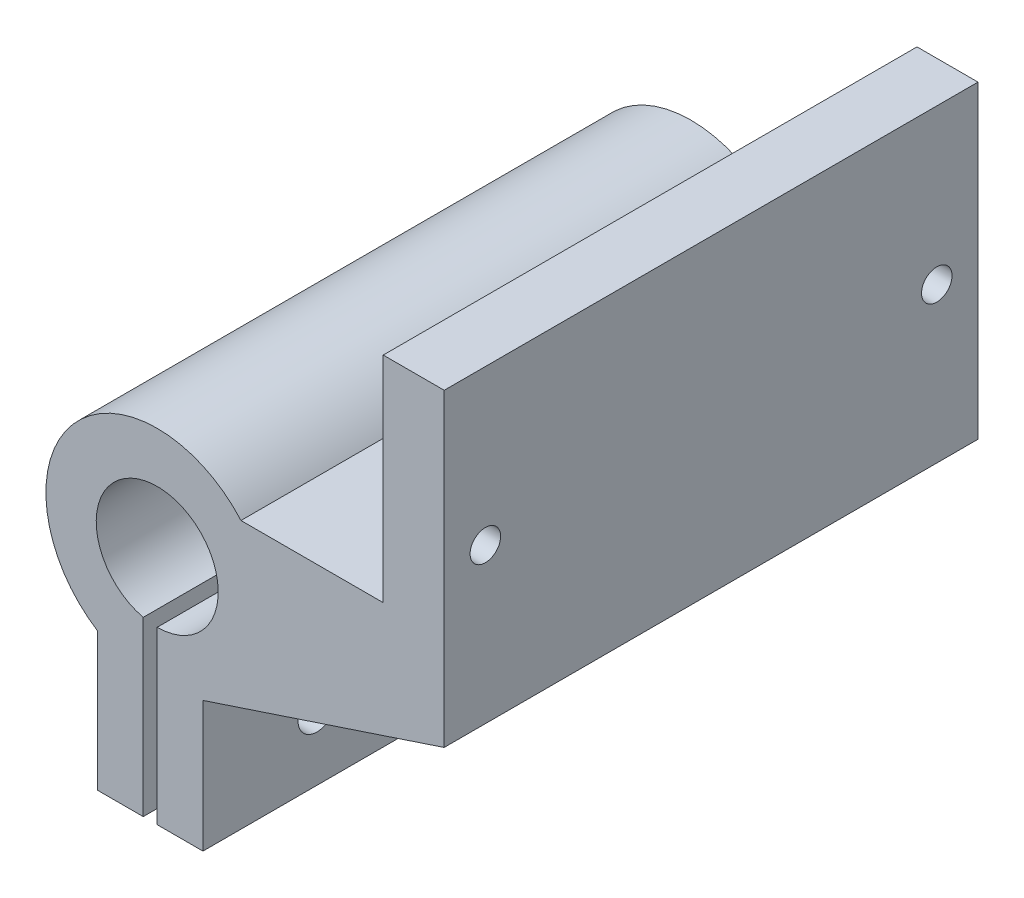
ISO-10303-21;
HEADER;
FILE_DESCRIPTION(('STEP AP214'),'2;1');
FILE_NAME('part.step','',(''),(''),'','','');
FILE_SCHEMA(('AUTOMOTIVE_DESIGN { 1 0 10303 214 1 1 1 1 }'));
ENDSEC;
DATA;
#1=APPLICATION_CONTEXT('core data for automotive mechanical design processes');
#2=APPLICATION_PROTOCOL_DEFINITION('international standard','automotive_design',2000,#1);
#3=PRODUCT_CONTEXT('',#1,'mechanical');
#4=PRODUCT('Part','Part','',(#3));
#5=PRODUCT_RELATED_PRODUCT_CATEGORY('part','',(#4));
#6=PRODUCT_DEFINITION_FORMATION('','',#4);
#7=PRODUCT_DEFINITION_CONTEXT('part definition',#1,'design');
#8=PRODUCT_DEFINITION('design','',#6,#7);
#9=PRODUCT_DEFINITION_SHAPE('','',#8);
#10=(LENGTH_UNIT() NAMED_UNIT(*) SI_UNIT(.MILLI.,.METRE.));
#11=(NAMED_UNIT(*) PLANE_ANGLE_UNIT() SI_UNIT($,.RADIAN.));
#12=(NAMED_UNIT(*) SI_UNIT($,.STERADIAN.) SOLID_ANGLE_UNIT());
#13=UNCERTAINTY_MEASURE_WITH_UNIT(LENGTH_MEASURE(1.E-05),#10,'distance_accuracy_value','');
#14=(GEOMETRIC_REPRESENTATION_CONTEXT(3) GLOBAL_UNCERTAINTY_ASSIGNED_CONTEXT((#13)) GLOBAL_UNIT_ASSIGNED_CONTEXT((#10,
#11,#12)) REPRESENTATION_CONTEXT('',''));
#15=CARTESIAN_POINT('',(0.,0.,0.));
#16=DIRECTION('',(0.,0.,1.));
#17=DIRECTION('',(1.,0.,0.));
#18=AXIS2_PLACEMENT_3D('',#15,#16,#17);
#19=CARTESIAN_POINT('',(41.5901479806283,218.770293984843,35.));
#20=DIRECTION('',(-0.999999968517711,0.000250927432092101,0.));
#21=DIRECTION('',(-0.000250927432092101,-0.999999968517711,0.));
#22=AXIS2_PLACEMENT_3D('',#19,#20,#21);
#23=PLANE('',#22);
#24=CARTESIAN_POINT('',(41.5876027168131,208.626868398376,32.3));
#25=DIRECTION('',(0.999999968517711,-0.000250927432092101,0.));
#26=DIRECTION('',(0.000250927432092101,0.999999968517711,0.));
#27=AXIS2_PLACEMENT_3D('',#24,#25,#26);
#28=CIRCLE('',#27,1.);
#29=CARTESIAN_POINT('',(41.5878536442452,209.626868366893,32.3));
#30=VERTEX_POINT('',#29);
#31=EDGE_CURVE('E220',#30,#30,#28,.T.);
#32=ORIENTED_EDGE('',*,*,#31,.F.);
#33=EDGE_LOOP('',(#32));
#34=FACE_BOUND('',#33,.T.);
#35=CARTESIAN_POINT('',(41.5876027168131,208.626868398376,2.7));
#36=DIRECTION('',(0.999999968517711,-0.000250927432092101,0.));
#37=DIRECTION('',(-0.000250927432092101,-0.999999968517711,0.));
#38=AXIS2_PLACEMENT_3D('',#35,#36,#37);
#39=CIRCLE('',#38,1.);
#40=CARTESIAN_POINT('',(41.587351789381,207.626868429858,2.7));
#41=VERTEX_POINT('',#40);
#42=EDGE_CURVE('E212',#41,#41,#39,.T.);
#43=ORIENTED_EDGE('',*,*,#42,.F.);
#44=EDGE_LOOP('',(#43));
#45=FACE_BOUND('',#44,.T.);
#46=DIRECTION('',(0.000250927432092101,0.999999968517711,0.));
#47=VECTOR('',#46,1.);
#48=CARTESIAN_POINT('',(41.5901479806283,218.770293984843,0.));
#49=LINE('',#48,#47);
#50=CARTESIAN_POINT('',(41.585057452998,198.483442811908,0.));
#51=VERTEX_POINT('',#50);
#52=CARTESIAN_POINT('',(41.5901479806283,218.770293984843,0.));
#53=VERTEX_POINT('',#52);
#54=EDGE_CURVE('E160',#51,#53,#49,.T.);
#55=ORIENTED_EDGE('',*,*,#54,.T.);
#56=DIRECTION('',(0.,0.,-1.));
#57=VECTOR('',#56,1.);
#58=CARTESIAN_POINT('',(41.5901479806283,218.770293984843,35.));
#59=LINE('',#58,#57);
#60=CARTESIAN_POINT('',(41.5901479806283,218.770293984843,35.));
#61=VERTEX_POINT('',#60);
#62=EDGE_CURVE('E11',#61,#53,#59,.T.);
#63=ORIENTED_EDGE('',*,*,#62,.F.);
#64=DIRECTION('',(0.000250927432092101,0.999999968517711,0.));
#65=VECTOR('',#64,1.);
#66=CARTESIAN_POINT('',(41.5901479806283,218.770293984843,35.));
#67=LINE('',#66,#65);
#68=CARTESIAN_POINT('',(41.585057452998,198.483442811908,35.));
#69=VERTEX_POINT('',#68);
#70=EDGE_CURVE('E185',#69,#61,#67,.T.);
#71=ORIENTED_EDGE('',*,*,#70,.F.);
#72=DIRECTION('',(0.,0.,-1.));
#73=VECTOR('',#72,1.);
#74=CARTESIAN_POINT('',(41.585057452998,198.483442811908,35.));
#75=LINE('',#74,#73);
#76=EDGE_CURVE('E156',#69,#51,#75,.T.);
#77=ORIENTED_EDGE('',*,*,#76,.T.);
#78=EDGE_LOOP('',(#55,#63,#71,#77));
#79=FACE_BOUND('',#78,.T.);
#80=ADVANCED_FACE('F32',(#34,#45,#79),#23,.F.);
#81=CARTESIAN_POINT('',(41.5901479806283,218.770293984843,35.));
#82=DIRECTION('',(0.,-1.,0.));
#83=DIRECTION('',(0.,0.,-1.));
#84=AXIS2_PLACEMENT_3D('',#81,#82,#83);
#85=PLANE('',#84);
#86=DIRECTION('',(-1.,0.,0.));
#87=VECTOR('',#86,1.);
#88=CARTESIAN_POINT('',(41.5901479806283,218.770293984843,0.));
#89=LINE('',#88,#87);
#90=CARTESIAN_POINT('',(37.5901479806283,218.770293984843,0.));
#91=VERTEX_POINT('',#90);
#92=EDGE_CURVE('E163',#53,#91,#89,.T.);
#93=ORIENTED_EDGE('',*,*,#92,.T.);
#94=DIRECTION('',(0.,0.,-1.));
#95=VECTOR('',#94,1.);
#96=CARTESIAN_POINT('',(37.5901479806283,218.770293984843,35.));
#97=LINE('',#96,#95);
#98=CARTESIAN_POINT('',(37.5901479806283,218.770293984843,35.));
#99=VERTEX_POINT('',#98);
#100=EDGE_CURVE('E41',#99,#91,#97,.T.);
#101=ORIENTED_EDGE('',*,*,#100,.F.);
#102=DIRECTION('',(-1.,0.,0.));
#103=VECTOR('',#102,1.);
#104=CARTESIAN_POINT('',(41.5901479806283,218.770293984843,35.));
#105=LINE('',#104,#103);
#106=EDGE_CURVE('E108',#61,#99,#105,.T.);
#107=ORIENTED_EDGE('',*,*,#106,.F.);
#108=ORIENTED_EDGE('',*,*,#62,.T.);
#109=EDGE_LOOP('',(#93,#101,#107,#108));
#110=FACE_BOUND('',#109,.T.);
#111=ADVANCED_FACE('F268',(#110),#85,.F.);
#112=CARTESIAN_POINT('',(37.5901479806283,218.770293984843,35.));
#113=DIRECTION('',(1.,0.,0.));
#114=DIRECTION('',(0.,1.,0.));
#115=AXIS2_PLACEMENT_3D('',#112,#113,#114);
#116=PLANE('',#115);
#117=CARTESIAN_POINT('',(37.5901479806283,208.627871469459,32.3));
#118=DIRECTION('',(1.,0.,0.));
#119=DIRECTION('',(0.,-1.,0.));
#120=AXIS2_PLACEMENT_3D('',#117,#118,#119);
#121=ELLIPSE('',#120,1.00000003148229,1.);
#122=CARTESIAN_POINT('',(37.5901479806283,207.627871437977,32.3));
#123=VERTEX_POINT('',#122);
#124=EDGE_CURVE('E35',#123,#123,#121,.T.);
#125=ORIENTED_EDGE('',*,*,#124,.T.);
#126=EDGE_LOOP('',(#125));
#127=FACE_BOUND('',#126,.T.);
#128=CARTESIAN_POINT('',(37.5901479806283,208.627871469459,2.7));
#129=DIRECTION('',(1.,0.,0.));
#130=DIRECTION('',(0.,-1.,0.));
#131=AXIS2_PLACEMENT_3D('',#128,#129,#130);
#132=ELLIPSE('',#131,1.00000003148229,1.);
#133=CARTESIAN_POINT('',(37.5901479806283,207.627871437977,2.7));
#134=VERTEX_POINT('',#133);
#135=EDGE_CURVE('E164',#134,#134,#132,.T.);
#136=ORIENTED_EDGE('',*,*,#135,.T.);
#137=EDGE_LOOP('',(#136));
#138=FACE_BOUND('',#137,.T.);
#139=DIRECTION('',(0.,-1.,0.));
#140=VECTOR('',#139,1.);
#141=CARTESIAN_POINT('',(37.5901479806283,218.770293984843,0.));
#142=LINE('',#141,#140);
#143=CARTESIAN_POINT('',(37.5901479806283,204.710145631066,0.));
#144=VERTEX_POINT('',#143);
#145=EDGE_CURVE('E166',#91,#144,#142,.T.);
#146=ORIENTED_EDGE('',*,*,#145,.T.);
#147=DIRECTION('',(0.,0.,-1.));
#148=VECTOR('',#147,1.);
#149=CARTESIAN_POINT('',(37.5901479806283,204.710145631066,35.));
#150=LINE('',#149,#148);
#151=CARTESIAN_POINT('',(37.5901479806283,204.710145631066,35.));
#152=VERTEX_POINT('',#151);
#153=EDGE_CURVE('E207',#152,#144,#150,.T.);
#154=ORIENTED_EDGE('',*,*,#153,.F.);
#155=DIRECTION('',(0.,-1.,0.));
#156=VECTOR('',#155,1.);
#157=CARTESIAN_POINT('',(37.5901479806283,218.770293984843,35.));
#158=LINE('',#157,#156);
#159=EDGE_CURVE('E226',#99,#152,#158,.T.);
#160=ORIENTED_EDGE('',*,*,#159,.F.);
#161=ORIENTED_EDGE('',*,*,#100,.T.);
#162=EDGE_LOOP('',(#146,#154,#160,#161));
#163=FACE_BOUND('',#162,.T.);
#164=ADVANCED_FACE('F273',(#127,#138,#163),#116,.F.);
#165=CARTESIAN_POINT('',(37.5901479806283,204.710145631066,35.));
#166=DIRECTION('',(0.,-1.,0.));
#167=DIRECTION('',(0.,0.,-1.));
#168=AXIS2_PLACEMENT_3D('',#165,#166,#167);
#169=PLANE('',#168);
#170=DIRECTION('',(-1.,0.,0.));
#171=VECTOR('',#170,1.);
#172=CARTESIAN_POINT('',(37.5901479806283,204.710145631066,0.));
#173=LINE('',#172,#171);
#174=CARTESIAN_POINT('',(28.2611395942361,204.710145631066,0.));
#175=VERTEX_POINT('',#174);
#176=EDGE_CURVE('E168',#144,#175,#173,.T.);
#177=ORIENTED_EDGE('',*,*,#176,.T.);
#178=DIRECTION('',(0.,0.,-1.));
#179=VECTOR('',#178,1.);
#180=CARTESIAN_POINT('',(28.2611395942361,204.710145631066,35.));
#181=LINE('',#180,#179);
#182=CARTESIAN_POINT('',(28.2611395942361,204.710145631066,35.));
#183=VERTEX_POINT('',#182);
#184=EDGE_CURVE('E204',#183,#175,#181,.T.);
#185=ORIENTED_EDGE('',*,*,#184,.F.);
#186=DIRECTION('',(-1.,0.,0.));
#187=VECTOR('',#186,1.);
#188=CARTESIAN_POINT('',(37.5901479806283,204.710145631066,35.));
#189=LINE('',#188,#187);
#190=EDGE_CURVE('E228',#152,#183,#189,.T.);
#191=ORIENTED_EDGE('',*,*,#190,.F.);
#192=ORIENTED_EDGE('',*,*,#153,.T.);
#193=EDGE_LOOP('',(#177,#185,#191,#192));
#194=FACE_BOUND('',#193,.T.);
#195=ADVANCED_FACE('F343',(#194),#169,.F.);
#196=CARTESIAN_POINT('',(22.7704220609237,199.902156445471,35.));
#197=DIRECTION('',(0.,0.,-1.));
#198=DIRECTION('',(-1.,0.,0.));
#199=AXIS2_PLACEMENT_3D('',#196,#197,#198);
#200=CYLINDRICAL_SURFACE('',#199,7.29826959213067);
#201=CARTESIAN_POINT('',(22.7704220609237,199.902156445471,0.));
#202=DIRECTION('',(0.,0.,1.));
#203=DIRECTION('',(1.,0.,0.));
#204=AXIS2_PLACEMENT_3D('',#201,#202,#203);
#205=CIRCLE('',#204,7.29826959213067);
#206=CARTESIAN_POINT('',(18.8539317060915,193.743760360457,0.));
#207=VERTEX_POINT('',#206);
#208=EDGE_CURVE('E170',#175,#207,#205,.T.);
#209=ORIENTED_EDGE('',*,*,#208,.T.);
#210=DIRECTION('',(0.,0.,-1.));
#211=VECTOR('',#210,1.);
#212=CARTESIAN_POINT('',(18.8539317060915,193.743760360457,35.));
#213=LINE('',#212,#211);
#214=CARTESIAN_POINT('',(18.8539317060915,193.743760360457,35.));
#215=VERTEX_POINT('',#214);
#216=EDGE_CURVE('E201',#215,#207,#213,.T.);
#217=ORIENTED_EDGE('',*,*,#216,.F.);
#218=CARTESIAN_POINT('',(22.7704220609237,199.902156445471,35.));
#219=DIRECTION('',(0.,0.,1.));
#220=DIRECTION('',(1.,0.,0.));
#221=AXIS2_PLACEMENT_3D('',#218,#219,#220);
#222=CIRCLE('',#221,7.29826959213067);
#223=EDGE_CURVE('E230',#183,#215,#222,.T.);
#224=ORIENTED_EDGE('',*,*,#223,.F.);
#225=ORIENTED_EDGE('',*,*,#184,.T.);
#226=EDGE_LOOP('',(#209,#217,#224,#225));
#227=FACE_BOUND('',#226,.T.);
#228=ADVANCED_FACE('F339',(#227),#200,.T.);
#229=CARTESIAN_POINT('',(18.8539317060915,193.743760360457,35.));
#230=DIRECTION('',(1.,0.,0.));
#231=DIRECTION('',(0.,0.,-1.));
#232=AXIS2_PLACEMENT_3D('',#229,#230,#231);
#233=PLANE('',#232);
#234=CARTESIAN_POINT('',(18.8539317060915,188.969409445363,27.5175352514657));
#235=DIRECTION('',(1.,0.,0.));
#236=DIRECTION('',(0.,0.,-1.));
#237=AXIS2_PLACEMENT_3D('',#234,#235,#236);
#238=CIRCLE('',#237,1.25);
#239=CARTESIAN_POINT('',(18.8539317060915,188.969409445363,26.2675352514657));
#240=VERTEX_POINT('',#239);
#241=EDGE_CURVE('E292',#240,#240,#238,.T.);
#242=ORIENTED_EDGE('',*,*,#241,.T.);
#243=EDGE_LOOP('',(#242));
#244=FACE_BOUND('',#243,.T.);
#245=CARTESIAN_POINT('',(18.8539317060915,188.969409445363,7.48246474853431));
#246=DIRECTION('',(1.,0.,0.));
#247=DIRECTION('',(0.,0.,-1.));
#248=AXIS2_PLACEMENT_3D('',#245,#246,#247);
#249=CIRCLE('',#248,1.25);
#250=CARTESIAN_POINT('',(18.8539317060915,188.969409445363,6.23246474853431));
#251=VERTEX_POINT('',#250);
#252=EDGE_CURVE('E278',#251,#251,#249,.T.);
#253=ORIENTED_EDGE('',*,*,#252,.T.);
#254=EDGE_LOOP('',(#253));
#255=FACE_BOUND('',#254,.T.);
#256=DIRECTION('',(0.,-1.,0.));
#257=VECTOR('',#256,1.);
#258=CARTESIAN_POINT('',(18.8539317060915,193.743760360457,0.));
#259=LINE('',#258,#257);
#260=CARTESIAN_POINT('',(18.8539317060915,184.689837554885,0.));
#261=VERTEX_POINT('',#260);
#262=EDGE_CURVE('E172',#207,#261,#259,.T.);
#263=ORIENTED_EDGE('',*,*,#262,.T.);
#264=DIRECTION('',(0.,0.,-1.));
#265=VECTOR('',#264,1.);
#266=CARTESIAN_POINT('',(18.8539317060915,184.689837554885,35.));
#267=LINE('',#266,#265);
#268=CARTESIAN_POINT('',(18.8539317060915,184.689837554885,35.));
#269=VERTEX_POINT('',#268);
#270=EDGE_CURVE('E198',#269,#261,#267,.T.);
#271=ORIENTED_EDGE('',*,*,#270,.F.);
#272=DIRECTION('',(0.,-1.,0.));
#273=VECTOR('',#272,1.);
#274=CARTESIAN_POINT('',(18.8539317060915,193.743760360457,35.));
#275=LINE('',#274,#273);
#276=EDGE_CURVE('E232',#215,#269,#275,.T.);
#277=ORIENTED_EDGE('',*,*,#276,.F.);
#278=ORIENTED_EDGE('',*,*,#216,.T.);
#279=EDGE_LOOP('',(#263,#271,#277,#278));
#280=FACE_BOUND('',#279,.T.);
#281=ADVANCED_FACE('F335',(#244,#255,#280),#233,.F.);
#282=CARTESIAN_POINT('',(18.8539317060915,184.689837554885,35.));
#283=DIRECTION('',(0.,1.,0.));
#284=DIRECTION('',(0.,0.,1.));
#285=AXIS2_PLACEMENT_3D('',#282,#283,#284);
#286=PLANE('',#285);
#287=DIRECTION('',(1.,0.,0.));
#288=VECTOR('',#287,1.);
#289=CARTESIAN_POINT('',(18.8539317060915,184.689837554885,0.));
#290=LINE('',#289,#288);
#291=CARTESIAN_POINT('',(21.8539317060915,184.689837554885,0.));
#292=VERTEX_POINT('',#291);
#293=EDGE_CURVE('E174',#261,#292,#290,.T.);
#294=ORIENTED_EDGE('',*,*,#293,.T.);
#295=DIRECTION('',(0.,0.,-1.));
#296=VECTOR('',#295,1.);
#297=CARTESIAN_POINT('',(21.8539317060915,184.689837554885,35.));
#298=LINE('',#297,#296);
#299=CARTESIAN_POINT('',(21.8539317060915,184.689837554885,35.));
#300=VERTEX_POINT('',#299);
#301=EDGE_CURVE('E195',#300,#292,#298,.T.);
#302=ORIENTED_EDGE('',*,*,#301,.F.);
#303=DIRECTION('',(1.,0.,0.));
#304=VECTOR('',#303,1.);
#305=CARTESIAN_POINT('',(18.8539317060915,184.689837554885,35.));
#306=LINE('',#305,#304);
#307=EDGE_CURVE('E234',#269,#300,#306,.T.);
#308=ORIENTED_EDGE('',*,*,#307,.F.);
#309=ORIENTED_EDGE('',*,*,#270,.T.);
#310=EDGE_LOOP('',(#294,#302,#308,#309));
#311=FACE_BOUND('',#310,.T.);
#312=ADVANCED_FACE('F331',(#311),#286,.F.);
#313=CARTESIAN_POINT('',(21.8539317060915,184.689837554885,35.));
#314=DIRECTION('',(-1.,0.,0.));
#315=DIRECTION('',(0.,0.,1.));
#316=AXIS2_PLACEMENT_3D('',#313,#314,#315);
#317=PLANE('',#316);
#318=CARTESIAN_POINT('',(21.8539317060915,188.969409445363,27.5175352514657));
#319=DIRECTION('',(-1.,0.,0.));
#320=DIRECTION('',(0.,0.,1.));
#321=AXIS2_PLACEMENT_3D('',#318,#319,#320);
#322=CIRCLE('',#321,1.25);
#323=CARTESIAN_POINT('',(21.8539317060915,188.969409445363,28.7675352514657));
#324=VERTEX_POINT('',#323);
#325=EDGE_CURVE('E295',#324,#324,#322,.T.);
#326=ORIENTED_EDGE('',*,*,#325,.T.);
#327=EDGE_LOOP('',(#326));
#328=FACE_BOUND('',#327,.T.);
#329=CARTESIAN_POINT('',(21.8539317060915,188.969409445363,7.48246474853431));
#330=DIRECTION('',(-1.,0.,0.));
#331=DIRECTION('',(0.,0.,1.));
#332=AXIS2_PLACEMENT_3D('',#329,#330,#331);
#333=CIRCLE('',#332,1.25);
#334=CARTESIAN_POINT('',(21.8539317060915,188.969409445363,8.73246474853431));
#335=VERTEX_POINT('',#334);
#336=EDGE_CURVE('E280',#335,#335,#333,.T.);
#337=ORIENTED_EDGE('',*,*,#336,.T.);
#338=EDGE_LOOP('',(#337));
#339=FACE_BOUND('',#338,.T.);
#340=DIRECTION('',(0.,1.,0.));
#341=VECTOR('',#340,1.);
#342=CARTESIAN_POINT('',(21.8539317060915,184.689837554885,0.));
#343=LINE('',#342,#341);
#344=CARTESIAN_POINT('',(21.8539317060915,196.008566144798,0.));
#345=VERTEX_POINT('',#344);
#346=EDGE_CURVE('E176',#292,#345,#343,.T.);
#347=ORIENTED_EDGE('',*,*,#346,.T.);
#348=DIRECTION('',(0.,0.,-1.));
#349=VECTOR('',#348,1.);
#350=CARTESIAN_POINT('',(21.8539317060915,196.008566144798,35.));
#351=LINE('',#350,#349);
#352=CARTESIAN_POINT('',(21.8539317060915,196.008566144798,35.));
#353=VERTEX_POINT('',#352);
#354=EDGE_CURVE('E192',#353,#345,#351,.T.);
#355=ORIENTED_EDGE('',*,*,#354,.F.);
#356=DIRECTION('',(0.,1.,0.));
#357=VECTOR('',#356,1.);
#358=CARTESIAN_POINT('',(21.8539317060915,184.689837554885,35.));
#359=LINE('',#358,#357);
#360=EDGE_CURVE('E236',#300,#353,#359,.T.);
#361=ORIENTED_EDGE('',*,*,#360,.F.);
#362=ORIENTED_EDGE('',*,*,#301,.T.);
#363=EDGE_LOOP('',(#347,#355,#361,#362));
#364=FACE_BOUND('',#363,.T.);
#365=ADVANCED_FACE('F326',(#328,#339,#364),#317,.F.);
#366=CARTESIAN_POINT('',(22.7704220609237,199.902156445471,35.));
#367=DIRECTION('',(0.,0.,-1.));
#368=DIRECTION('',(-1.,0.,0.));
#369=AXIS2_PLACEMENT_3D('',#366,#367,#368);
#370=CYLINDRICAL_SURFACE('',#369,4.);
#371=CARTESIAN_POINT('',(22.7704220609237,199.902156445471,0.));
#372=DIRECTION('',(0.,0.,-1.));
#373=DIRECTION('',(1.,0.,0.));
#374=AXIS2_PLACEMENT_3D('',#371,#372,#373);
#375=CIRCLE('',#374,4.);
#376=CARTESIAN_POINT('',(22.7704220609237,195.902156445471,0.));
#377=VERTEX_POINT('',#376);
#378=EDGE_CURVE('E178',#345,#377,#375,.T.);
#379=ORIENTED_EDGE('',*,*,#378,.T.);
#380=DIRECTION('',(0.,0.,-1.));
#381=VECTOR('',#380,1.);
#382=CARTESIAN_POINT('',(22.7704220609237,195.902156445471,35.));
#383=LINE('',#382,#381);
#384=CARTESIAN_POINT('',(22.7704220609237,195.902156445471,35.));
#385=VERTEX_POINT('',#384);
#386=EDGE_CURVE('E189',#385,#377,#383,.T.);
#387=ORIENTED_EDGE('',*,*,#386,.F.);
#388=CARTESIAN_POINT('',(22.7704220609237,199.902156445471,35.));
#389=DIRECTION('',(0.,0.,-1.));
#390=DIRECTION('',(1.,0.,0.));
#391=AXIS2_PLACEMENT_3D('',#388,#389,#390);
#392=CIRCLE('',#391,4.);
#393=EDGE_CURVE('E238',#353,#385,#392,.T.);
#394=ORIENTED_EDGE('',*,*,#393,.F.);
#395=ORIENTED_EDGE('',*,*,#354,.T.);
#396=EDGE_LOOP('',(#379,#387,#394,#395));
#397=FACE_BOUND('',#396,.T.);
#398=ADVANCED_FACE('F244',(#397),#370,.F.);
#399=CARTESIAN_POINT('',(22.7704220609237,184.689837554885,35.));
#400=DIRECTION('',(1.,0.,0.));
#401=DIRECTION('',(0.,0.,-1.));
#402=AXIS2_PLACEMENT_3D('',#399,#400,#401);
#403=PLANE('',#402);
#404=CARTESIAN_POINT('',(22.7704220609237,188.969409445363,27.5175352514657));
#405=DIRECTION('',(1.,0.,0.));
#406=DIRECTION('',(0.,0.,-1.));
#407=AXIS2_PLACEMENT_3D('',#404,#405,#406);
#408=CIRCLE('',#407,1.25);
#409=CARTESIAN_POINT('',(22.7704220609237,188.969409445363,26.2675352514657));
#410=VERTEX_POINT('',#409);
#411=EDGE_CURVE('E298',#410,#410,#408,.T.);
#412=ORIENTED_EDGE('',*,*,#411,.T.);
#413=EDGE_LOOP('',(#412));
#414=FACE_BOUND('',#413,.T.);
#415=CARTESIAN_POINT('',(22.7704220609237,188.969409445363,7.48246474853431));
#416=DIRECTION('',(1.,0.,0.));
#417=DIRECTION('',(0.,0.,-1.));
#418=AXIS2_PLACEMENT_3D('',#415,#416,#417);
#419=CIRCLE('',#418,1.25);
#420=CARTESIAN_POINT('',(22.7704220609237,188.969409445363,6.23246474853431));
#421=VERTEX_POINT('',#420);
#422=EDGE_CURVE('E284',#421,#421,#419,.T.);
#423=ORIENTED_EDGE('',*,*,#422,.T.);
#424=EDGE_LOOP('',(#423));
#425=FACE_BOUND('',#424,.T.);
#426=DIRECTION('',(0.,-1.,0.));
#427=VECTOR('',#426,1.);
#428=CARTESIAN_POINT('',(22.7704220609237,184.689837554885,0.));
#429=LINE('',#428,#427);
#430=CARTESIAN_POINT('',(22.7704220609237,184.689837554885,0.));
#431=VERTEX_POINT('',#430);
#432=EDGE_CURVE('E180',#377,#431,#429,.T.);
#433=ORIENTED_EDGE('',*,*,#432,.T.);
#434=DIRECTION('',(0.,0.,-1.));
#435=VECTOR('',#434,1.);
#436=CARTESIAN_POINT('',(22.7704220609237,184.689837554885,35.));
#437=LINE('',#436,#435);
#438=CARTESIAN_POINT('',(22.7704220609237,184.689837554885,35.));
#439=VERTEX_POINT('',#438);
#440=EDGE_CURVE('E151',#439,#431,#437,.T.);
#441=ORIENTED_EDGE('',*,*,#440,.F.);
#442=DIRECTION('',(0.,-1.,0.));
#443=VECTOR('',#442,1.);
#444=CARTESIAN_POINT('',(22.7704220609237,184.689837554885,35.));
#445=LINE('',#444,#443);
#446=EDGE_CURVE('E142',#385,#439,#445,.T.);
#447=ORIENTED_EDGE('',*,*,#446,.F.);
#448=ORIENTED_EDGE('',*,*,#386,.T.);
#449=EDGE_LOOP('',(#433,#441,#447,#448));
#450=FACE_BOUND('',#449,.T.);
#451=ADVANCED_FACE('F248',(#414,#425,#450),#403,.F.);
#452=CARTESIAN_POINT('',(25.7704220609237,184.689837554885,35.));
#453=DIRECTION('',(0.,1.,0.));
#454=DIRECTION('',(0.,0.,1.));
#455=AXIS2_PLACEMENT_3D('',#452,#453,#454);
#456=PLANE('',#455);
#457=DIRECTION('',(1.,0.,0.));
#458=VECTOR('',#457,1.);
#459=CARTESIAN_POINT('',(25.7704220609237,184.689837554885,0.));
#460=LINE('',#459,#458);
#461=CARTESIAN_POINT('',(25.7704220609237,184.689837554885,0.));
#462=VERTEX_POINT('',#461);
#463=EDGE_CURVE('E150',#431,#462,#460,.T.);
#464=ORIENTED_EDGE('',*,*,#463,.T.);
#465=DIRECTION('',(0.,0.,-1.));
#466=VECTOR('',#465,1.);
#467=CARTESIAN_POINT('',(25.7704220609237,184.689837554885,35.));
#468=LINE('',#467,#466);
#469=CARTESIAN_POINT('',(25.7704220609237,184.689837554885,35.));
#470=VERTEX_POINT('',#469);
#471=EDGE_CURVE('E147',#470,#462,#468,.T.);
#472=ORIENTED_EDGE('',*,*,#471,.F.);
#473=DIRECTION('',(1.,0.,0.));
#474=VECTOR('',#473,1.);
#475=CARTESIAN_POINT('',(25.7704220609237,184.689837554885,35.));
#476=LINE('',#475,#474);
#477=EDGE_CURVE('E136',#439,#470,#476,.T.);
#478=ORIENTED_EDGE('',*,*,#477,.F.);
#479=ORIENTED_EDGE('',*,*,#440,.T.);
#480=EDGE_LOOP('',(#464,#472,#478,#479));
#481=FACE_BOUND('',#480,.T.);
#482=ADVANCED_FACE('F148',(#481),#456,.F.);
#483=CARTESIAN_POINT('',(25.7704220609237,193.24898133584,35.));
#484=DIRECTION('',(-1.,0.,0.));
#485=DIRECTION('',(0.,0.,1.));
#486=AXIS2_PLACEMENT_3D('',#483,#484,#485);
#487=PLANE('',#486);
#488=CARTESIAN_POINT('',(25.7704220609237,188.969409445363,27.5175352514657));
#489=DIRECTION('',(1.,0.,0.));
#490=DIRECTION('',(0.,0.,1.));
#491=AXIS2_PLACEMENT_3D('',#488,#489,#490);
#492=CIRCLE('',#491,1.25);
#493=CARTESIAN_POINT('',(25.7704220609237,188.969409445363,28.7675352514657));
#494=VERTEX_POINT('',#493);
#495=EDGE_CURVE('E301',#494,#494,#492,.T.);
#496=ORIENTED_EDGE('',*,*,#495,.F.);
#497=EDGE_LOOP('',(#496));
#498=FACE_BOUND('',#497,.T.);
#499=CARTESIAN_POINT('',(25.7704220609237,188.969409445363,7.48246474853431));
#500=DIRECTION('',(1.,0.,0.));
#501=DIRECTION('',(0.,0.,-1.));
#502=AXIS2_PLACEMENT_3D('',#499,#500,#501);
#503=CIRCLE('',#502,1.25);
#504=CARTESIAN_POINT('',(25.7704220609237,188.969409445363,6.23246474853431));
#505=VERTEX_POINT('',#504);
#506=EDGE_CURVE('E289',#505,#505,#503,.T.);
#507=ORIENTED_EDGE('',*,*,#506,.F.);
#508=EDGE_LOOP('',(#507));
#509=FACE_BOUND('',#508,.T.);
#510=DIRECTION('',(0.,1.,0.));
#511=VECTOR('',#510,1.);
#512=CARTESIAN_POINT('',(25.7704220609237,193.24898133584,0.));
#513=LINE('',#512,#511);
#514=CARTESIAN_POINT('',(25.7704220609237,193.24898133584,0.));
#515=VERTEX_POINT('',#514);
#516=EDGE_CURVE('E94',#462,#515,#513,.T.);
#517=ORIENTED_EDGE('',*,*,#516,.T.);
#518=DIRECTION('',(0.,0.,-1.));
#519=VECTOR('',#518,1.);
#520=CARTESIAN_POINT('',(25.7704220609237,193.24898133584,35.));
#521=LINE('',#520,#519);
#522=CARTESIAN_POINT('',(25.7704220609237,193.24898133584,35.));
#523=VERTEX_POINT('',#522);
#524=EDGE_CURVE('E152',#523,#515,#521,.T.);
#525=ORIENTED_EDGE('',*,*,#524,.F.);
#526=DIRECTION('',(0.,1.,0.));
#527=VECTOR('',#526,1.);
#528=CARTESIAN_POINT('',(25.7704220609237,193.24898133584,35.));
#529=LINE('',#528,#527);
#530=EDGE_CURVE('E140',#470,#523,#529,.T.);
#531=ORIENTED_EDGE('',*,*,#530,.F.);
#532=ORIENTED_EDGE('',*,*,#471,.T.);
#533=EDGE_LOOP('',(#517,#525,#531,#532));
#534=FACE_BOUND('',#533,.T.);
#535=ADVANCED_FACE('F154',(#498,#509,#534),#487,.F.);
#536=CARTESIAN_POINT('',(41.585057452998,198.483442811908,35.));
#537=DIRECTION('',(-0.314223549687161,0.949349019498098,0.));
#538=DIRECTION('',(-0.949349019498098,-0.314223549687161,0.));
#539=AXIS2_PLACEMENT_3D('',#536,#537,#538);
#540=PLANE('',#539);
#541=DIRECTION('',(0.949349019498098,0.314223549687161,0.));
#542=VECTOR('',#541,1.);
#543=CARTESIAN_POINT('',(41.585057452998,198.483442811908,0.));
#544=LINE('',#543,#542);
#545=EDGE_CURVE('E100',#515,#51,#544,.T.);
#546=ORIENTED_EDGE('',*,*,#545,.T.);
#547=ORIENTED_EDGE('',*,*,#76,.F.);
#548=DIRECTION('',(0.949349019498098,0.314223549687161,0.));
#549=VECTOR('',#548,1.);
#550=CARTESIAN_POINT('',(41.585057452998,198.483442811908,35.));
#551=LINE('',#550,#549);
#552=EDGE_CURVE('E50',#523,#69,#551,.T.);
#553=ORIENTED_EDGE('',*,*,#552,.F.);
#554=ORIENTED_EDGE('',*,*,#524,.T.);
#555=EDGE_LOOP('',(#546,#547,#553,#554));
#556=FACE_BOUND('',#555,.T.);
#557=ADVANCED_FACE('F256',(#556),#540,.F.);
#558=CARTESIAN_POINT('',(22.7704220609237,199.902156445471,35.));
#559=DIRECTION('',(0.,0.,1.));
#560=DIRECTION('',(1.,0.,0.));
#561=AXIS2_PLACEMENT_3D('',#558,#559,#560);
#562=PLANE('',#561);
#563=ORIENTED_EDGE('',*,*,#70,.T.);
#564=ORIENTED_EDGE('',*,*,#106,.T.);
#565=ORIENTED_EDGE('',*,*,#159,.T.);
#566=ORIENTED_EDGE('',*,*,#190,.T.);
#567=ORIENTED_EDGE('',*,*,#223,.T.);
#568=ORIENTED_EDGE('',*,*,#276,.T.);
#569=ORIENTED_EDGE('',*,*,#307,.T.);
#570=ORIENTED_EDGE('',*,*,#360,.T.);
#571=ORIENTED_EDGE('',*,*,#393,.T.);
#572=ORIENTED_EDGE('',*,*,#446,.T.);
#573=ORIENTED_EDGE('',*,*,#477,.T.);
#574=ORIENTED_EDGE('',*,*,#530,.T.);
#575=ORIENTED_EDGE('',*,*,#552,.T.);
#576=EDGE_LOOP('',(#563,#564,#565,#566,#567,#568,#569,#570,#571,#572,#573,#574,#575));
#577=FACE_BOUND('',#576,.T.);
#578=ADVANCED_FACE('F138',(#577),#562,.T.);
#579=CARTESIAN_POINT('',(22.7704220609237,199.902156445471,0.));
#580=DIRECTION('',(0.,0.,1.));
#581=DIRECTION('',(1.,0.,0.));
#582=AXIS2_PLACEMENT_3D('',#579,#580,#581);
#583=PLANE('',#582);
#584=ORIENTED_EDGE('',*,*,#54,.F.);
#585=ORIENTED_EDGE('',*,*,#545,.F.);
#586=ORIENTED_EDGE('',*,*,#516,.F.);
#587=ORIENTED_EDGE('',*,*,#463,.F.);
#588=ORIENTED_EDGE('',*,*,#432,.F.);
#589=ORIENTED_EDGE('',*,*,#378,.F.);
#590=ORIENTED_EDGE('',*,*,#346,.F.);
#591=ORIENTED_EDGE('',*,*,#293,.F.);
#592=ORIENTED_EDGE('',*,*,#262,.F.);
#593=ORIENTED_EDGE('',*,*,#208,.F.);
#594=ORIENTED_EDGE('',*,*,#176,.F.);
#595=ORIENTED_EDGE('',*,*,#145,.F.);
#596=ORIENTED_EDGE('',*,*,#92,.F.);
#597=EDGE_LOOP('',(#584,#585,#586,#587,#588,#589,#590,#591,#592,#593,#594,#595,#596));
#598=FACE_BOUND('',#597,.T.);
#599=ADVANCED_FACE('F251',(#598),#583,.F.);
#600=CARTESIAN_POINT('',(6.58760381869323,208.635650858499,2.7));
#601=DIRECTION('',(0.999999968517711,-0.000250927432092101,0.));
#602=DIRECTION('',(0.000250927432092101,0.999999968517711,0.));
#603=AXIS2_PLACEMENT_3D('',#600,#601,#602);
#604=CYLINDRICAL_SURFACE('',#603,1.);
#605=ORIENTED_EDGE('',*,*,#42,.T.);
#606=EDGE_LOOP('',(#605));
#607=FACE_BOUND('',#606,.T.);
#608=ORIENTED_EDGE('',*,*,#135,.F.);
#609=EDGE_LOOP('',(#608));
#610=FACE_BOUND('',#609,.T.);
#611=ADVANCED_FACE('F373',(#607,#610),#604,.F.);
#612=CARTESIAN_POINT('',(6.58760381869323,208.635650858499,32.3));
#613=DIRECTION('',(0.999999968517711,-0.000250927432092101,0.));
#614=DIRECTION('',(0.000250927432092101,0.999999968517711,0.));
#615=AXIS2_PLACEMENT_3D('',#612,#613,#614);
#616=CYLINDRICAL_SURFACE('',#615,1.);
#617=ORIENTED_EDGE('',*,*,#31,.T.);
#618=EDGE_LOOP('',(#617));
#619=FACE_BOUND('',#618,.T.);
#620=ORIENTED_EDGE('',*,*,#124,.F.);
#621=EDGE_LOOP('',(#620));
#622=FACE_BOUND('',#621,.T.);
#623=ADVANCED_FACE('F314',(#619,#622),#616,.F.);
#624=CARTESIAN_POINT('',(-9.22957793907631,188.969409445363,7.48246474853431));
#625=DIRECTION('',(1.,0.,0.));
#626=DIRECTION('',(0.,0.,-1.));
#627=AXIS2_PLACEMENT_3D('',#624,#625,#626);
#628=CYLINDRICAL_SURFACE('',#627,1.25);
#629=ORIENTED_EDGE('',*,*,#506,.T.);
#630=EDGE_LOOP('',(#629));
#631=FACE_BOUND('',#630,.T.);
#632=ORIENTED_EDGE('',*,*,#422,.F.);
#633=EDGE_LOOP('',(#632));
#634=FACE_BOUND('',#633,.T.);
#635=ADVANCED_FACE('F310',(#631,#634),#628,.F.);
#636=ORIENTED_EDGE('',*,*,#336,.F.);
#637=EDGE_LOOP('',(#636));
#638=FACE_BOUND('',#637,.T.);
#639=ORIENTED_EDGE('',*,*,#252,.F.);
#640=EDGE_LOOP('',(#639));
#641=FACE_BOUND('',#640,.T.);
#642=ADVANCED_FACE('F313',(#638,#641),#628,.F.);
#643=CARTESIAN_POINT('',(-9.22957793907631,188.969409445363,27.5175352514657));
#644=DIRECTION('',(1.,0.,0.));
#645=DIRECTION('',(0.,0.,-1.));
#646=AXIS2_PLACEMENT_3D('',#643,#644,#645);
#647=CYLINDRICAL_SURFACE('',#646,1.25);
#648=ORIENTED_EDGE('',*,*,#495,.T.);
#649=EDGE_LOOP('',(#648));
#650=FACE_BOUND('',#649,.T.);
#651=ORIENTED_EDGE('',*,*,#411,.F.);
#652=EDGE_LOOP('',(#651));
#653=FACE_BOUND('',#652,.T.);
#654=ADVANCED_FACE('F305',(#650,#653),#647,.F.);
#655=ORIENTED_EDGE('',*,*,#325,.F.);
#656=EDGE_LOOP('',(#655));
#657=FACE_BOUND('',#656,.T.);
#658=ORIENTED_EDGE('',*,*,#241,.F.);
#659=EDGE_LOOP('',(#658));
#660=FACE_BOUND('',#659,.T.);
#661=ADVANCED_FACE('F445',(#657,#660),#647,.F.);
#662=CLOSED_SHELL('',(#80,#111,#164,#195,#228,#281,#312,#365,#398,#451,#482,#535,#557,#578,#599,
#611,#623,#635,#642,#654,#661));
#663=MANIFOLD_SOLID_BREP('B2',#662);
#664=ADVANCED_BREP_SHAPE_REPRESENTATION('',(#18,#663),#14);
#665=SHAPE_DEFINITION_REPRESENTATION(#9,#664);
ENDSEC;
END-ISO-10303-21;
